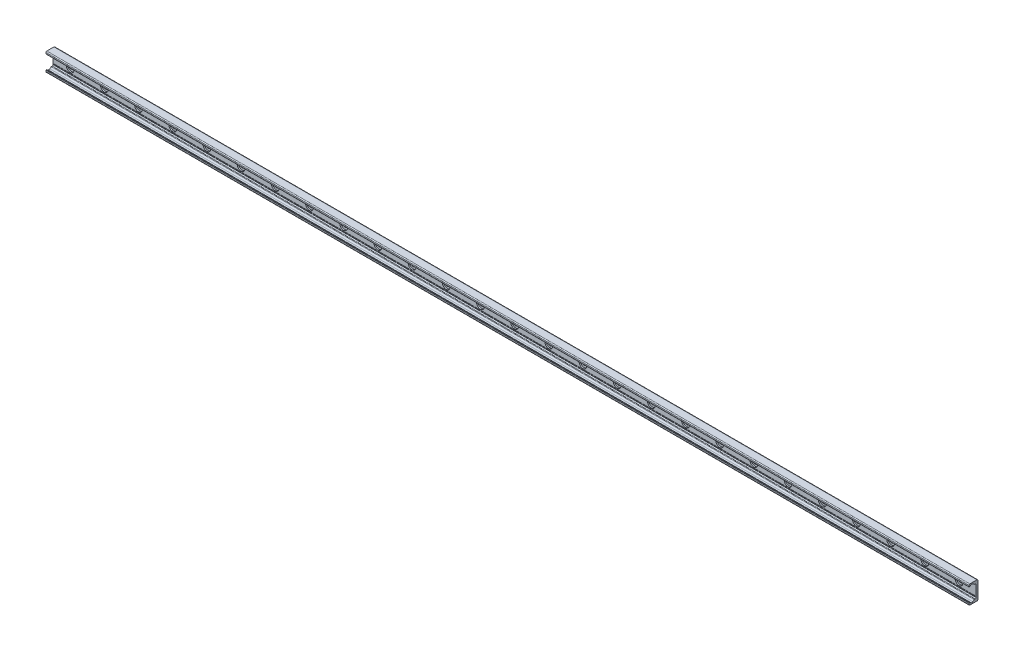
from build123d import *

# Parameters (mm, degrees)
BOSS_EXTRUDE1_DEPTH = 1080
SKETCH2_R           = 9
SKETCH2_R_2         = 4.5
CUT_EXTRUDE1_DEPTH  = 3.1
SKETCH2_2_R         = 4.5
CUT_EXTRUDE2_DEPTH  = 1081.33999278
LPATTERN1_COUNT     = 27
LPATTERN1_PITCH     = 80


with BuildPart() as part:
    # Sketch1 → Boss-Extrude1 (new, symmetric)
    with BuildSketch(Plane(origin=(0, 0, 0), x_dir=(0, 0, -1), z_dir=(1, 0, 0))):
        with BuildLine():
            Line((0, 0), (0, 19))
            ThreePointArc((0, 19), (-0.732233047, 20.767766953), (-2.5, 21.5))
            Line((-2.5, 21.5), (-19, 21.5))
            ThreePointArc((-19, 21.5), (-20.414213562, 20.914213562), (-21, 19.5))
            Line((-21, 19.5), (-21, 16.625057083))
            ThreePointArc((-21, 16.625057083), (-20.553251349, 15.888838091), (-19.693931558, 15.945160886))
            Line((-19.693931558, 15.945160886), (-16.794305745, 17.975500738))
            ThreePointArc((-16.794305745, 17.975500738), (-14.5, 18.69889256), (-12.205694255, 17.975500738))
            Line((-12.205694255, 17.975500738), (-8.829831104, 15.611695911))
            ThreePointArc((-8.829831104, 15.611695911), (-8.28408983, 15.342566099), (-7.682678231, 15.25))
            Line((-7.682678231, 15.25), (-6.5, 15.25))
            ThreePointArc((-6.5, 15.25), (-5.085786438, 14.664213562), (-4.5, 13.25))
            Line((-4.5, 13.25), (-4.5, -10.75))
            ThreePointArc((-4.5, -10.75), (-4.25, -11), (-4.5, -11.25))
            Line((-4.5, -11.25), (-4.5, -12.25))
            ThreePointArc((-4.5, -12.25), (-4.25, -12.5), (-4.5, -12.75))
            Line((-4.5, -12.75), (-4.5, -13.25))
            ThreePointArc((-4.5, -13.25), (-5.085786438, -14.664213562), (-6.5, -15.25))
            Line((-6.5, -15.25), (-7.682678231, -15.25))
            ThreePointArc((-7.682678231, -15.25), (-8.28408983, -15.342566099), (-8.829831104, -15.611695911))
            Line((-8.829831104, -15.611695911), (-12.205694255, -17.975500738))
            ThreePointArc((-12.205694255, -17.975500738), (-14.5, -18.69889256), (-16.794305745, -17.975500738))
            Line((-16.794305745, -17.975500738), (-19.693931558, -15.945160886))
            ThreePointArc((-19.693931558, -15.945160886), (-20.553251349, -15.888838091), (-21, -16.625057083))
            Line((-21, -16.625057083), (-21, -19.5))
            ThreePointArc((-21, -19.5), (-20.414213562, -20.914213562), (-19, -21.5))
            Line((-19, -21.5), (-2.5, -21.5))
            ThreePointArc((-2.5, -21.5), (-0.732233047, -20.767766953), (0, -19))
            Line((0, -19), (0, 0))
        make_face()
    extrude(amount=BOSS_EXTRUDE1_DEPTH, both=True)

    # Sketch2 → Cut-Extrude1 (cut)
    with BuildSketch(Plane.XY.offset(4.5)):
        with Locations((1040, 0)):
            Circle(SKETCH2_R)
        with Locations((1040, 0)):
            Circle(SKETCH2_R_2, mode=Mode.SUBTRACT)
    cut_extrude1 = extrude(amount=-CUT_EXTRUDE1_DEPTH, mode=Mode.SUBTRACT)

    # Sketch2_2 → Cut-Extrude2 (cut, through all)
    with BuildSketch(Plane.XY.offset(4.5)):
        with Locations((1040, 0)):
            Circle(SKETCH2_2_R)
    cut_extrude2 = extrude(amount=-CUT_EXTRUDE2_DEPTH, mode=Mode.SUBTRACT)

    # LPattern1: Cut-Extrude1, Cut-Extrude2 ×27
    with Locations(*[(-i * LPATTERN1_PITCH, 0, 0) for i in range(1, LPATTERN1_COUNT)]):
        add(cut_extrude1, mode=Mode.SUBTRACT)
        add(cut_extrude2, mode=Mode.SUBTRACT)


solid = part.part
